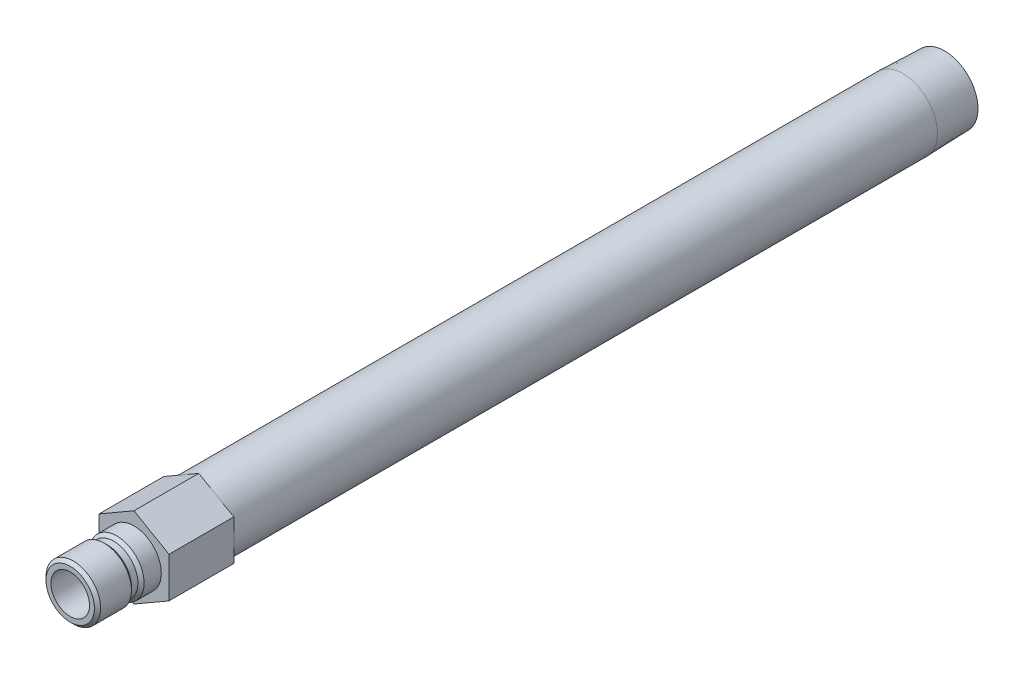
from build123d import *

# Parameters (mm, degrees)
SKETCH2_R           = 4.7625
BOSS_EXTRUDE1_DEPTH = 16.002


with BuildPart() as part:
    # Sketch1 → Revolve1 (revolve)
    with BuildSketch(Plane(origin=(0, 0, 0), x_dir=(0, 0, -1), z_dir=(1, 0, 0))):
        Polygon((-15.748, 4.7625), (-15.748, 5.9817), (-14.986, 6.7437), (-7.366, 6.7437), (-6.604, 5.9817), (-5.0165, 5.9817), (-4.2545, 6.7437), (0, 6.7437), (0, 8.5725), (189.8142, 8.5725), (200.152, 8.249445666), (200.152, 6.2611), (16.002, 6.2611), (16.002, 4.7625), align=None)
    revolve(axis=Axis((0, 0, 0), (0, 0, 1)))

    # Sketch2 → Boss-Extrude1 (add)
    with BuildSketch(Plane.XY):
        Polygon((-8.636, 4.985996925), (-8.636, -4.985996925), (0, -9.971993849), (8.636, -4.985996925), (8.636, 4.985996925), (0, 9.971993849), align=None)
        with Locations(Location((0, 0, 0), (0, 0, 90))):
            Circle(SKETCH2_R, mode=Mode.SUBTRACT)
    extrude(amount=-BOSS_EXTRUDE1_DEPTH)


solid = part.part
